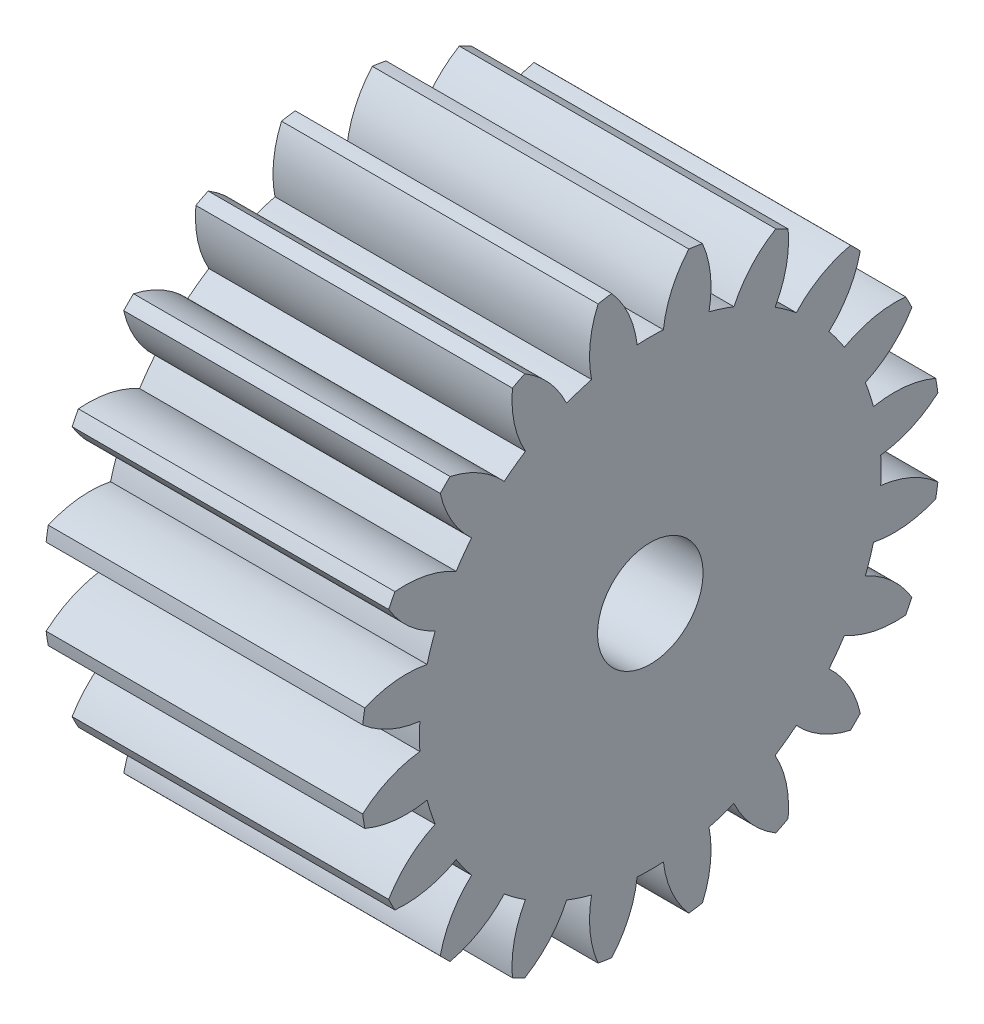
from build123d import *

# Parameters (mm, degrees)
BASPROSKE_W     = 15
BASPROSKE_H     = 13.75
TOOTHCUT_DEPTH  = 25.55860338
TEETHCUTS_COUNT = 20
TEETHCUTS_ANGLE = 342
BORSKE_R        = 2.5
BORE_DEPTH      = 50.0000508


with BuildPart() as part:
    # BasProSke → Base-Revolve (revolve)
    with BuildSketch(Plane(origin=(0, 0, 0), x_dir=(1, 0, 0), z_dir=(0, 1, 0)), mode=Mode.PRIVATE) as base_revolve_sk:
        with Locations((7.5, 6.875)):
            Rectangle(BASPROSKE_W, BASPROSKE_H)
    revolve(base_revolve_sk.sketch.rotate(Axis((-10, 0, 0), (1, 0, 0)), 180), axis=Axis((-10, 0, 0), (1, 0, 0)))

    # TooCutSke → ToothCut (cut, through all)
    with BuildSketch(Plane(origin=(0, 0, 0), x_dir=(0, 0, -1), z_dir=(1, 0, 0))):
        with BuildLine():
            ThreePointArc((0.62110296, 10.918848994), (0, 10.9365), (-0.62110296, 10.918848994))
            ThreePointArc((-0.62110296, 10.918848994), (-1.024517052, 12.378857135), (-1.846615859, 13.651067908))
            ThreePointArc((-1.846615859, 13.651067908), (0, 13.7754), (1.846615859, 13.651067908))
            ThreePointArc((1.846615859, 13.651067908), (1.024517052, 12.378857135), (0.62110296, 10.918848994))
        make_face()
    toothcut = extrude(amount=TOOTHCUT_DEPTH, mode=Mode.SUBTRACT)

    # TeethCuts: ToothCut ×20 about axis
    teethcuts_axis = Axis((-10, 0, 0), (1, 0, 0))
    for i in range(1, TEETHCUTS_COUNT):
        add(toothcut.rotate(teethcuts_axis, i * TEETHCUTS_ANGLE / (TEETHCUTS_COUNT - 1)), mode=Mode.SUBTRACT)

    # BorSke → Bore (cut, symmetric)
    with BuildSketch(Plane(origin=(0, 0, 0), x_dir=(0, 0, -1), z_dir=(1, 0, 0))):
        with Locations(Location((0, 0, 0), (0, 0, 180))):
            Circle(BORSKE_R)
    extrude(amount=BORE_DEPTH, both=True, mode=Mode.SUBTRACT)


solid = part.part
